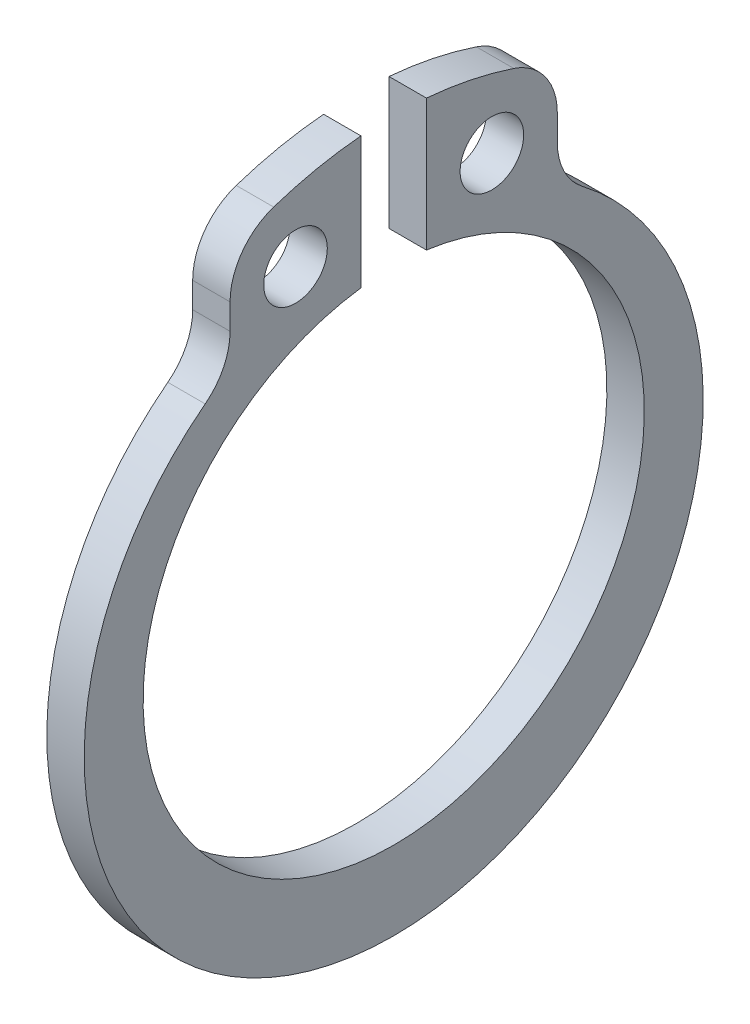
from build123d import *

# Parameters (mm, degrees)
ESQUISSE1_R      = 0.85
EXTRUSION1_DEPTH = 1


with BuildPart() as part:
    # Esquisse1 → Extrusion1 (new body)
    with BuildSketch(Plane(origin=(0, 0, 0), x_dir=(0, 0, -1), z_dir=(1, 0, 0))):
        with BuildLine():
            Line((4.375, 7.386700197), (4.375, 8.068108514))
            ThreePointArc((4.375, 8.068108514), (4.053314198, 9.063221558), (3.210000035, 9.681730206))
            ThreePointArc((3.210000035, 9.681730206), (2.05659116, 9.990517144), (0.875, 10.162400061))
            Line((0.875, 10.162400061), (0.875, 6.642618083))
            ThreePointArc((0.875, 6.642618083), (0, -6.7), (-0.875, 6.642618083))
            Line((-0.875, 6.642618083), (-0.875, 10.162400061))
            ThreePointArc((-0.875, 10.162400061), (-2.056591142, 9.990517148), (-3.21, 9.681730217))
            ThreePointArc((-3.21, 9.681730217), (-4.053314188, 9.063221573), (-4.375, 8.068108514))
            Line((-4.375, 8.068108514), (-4.375, 7.386700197))
            ThreePointArc((-4.375, 7.386700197), (-4.550192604, 6.635060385), (-5.039661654, 6.038340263))
            ThreePointArc((-5.039661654, 6.038340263), (0, -8.8), (5.039661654, 6.038340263))
            ThreePointArc((5.039661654, 6.038340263), (4.550192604, 6.635060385), (4.375, 7.386700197))
        make_face()
        with Locations((2.625, 8.01040078)):
            Circle(ESQUISSE1_R, mode=Mode.SUBTRACT)
        with Locations((-2.625, 8.01040078)):
            Circle(ESQUISSE1_R, mode=Mode.SUBTRACT)
    extrude(amount=EXTRUSION1_DEPTH)


solid = part.part
